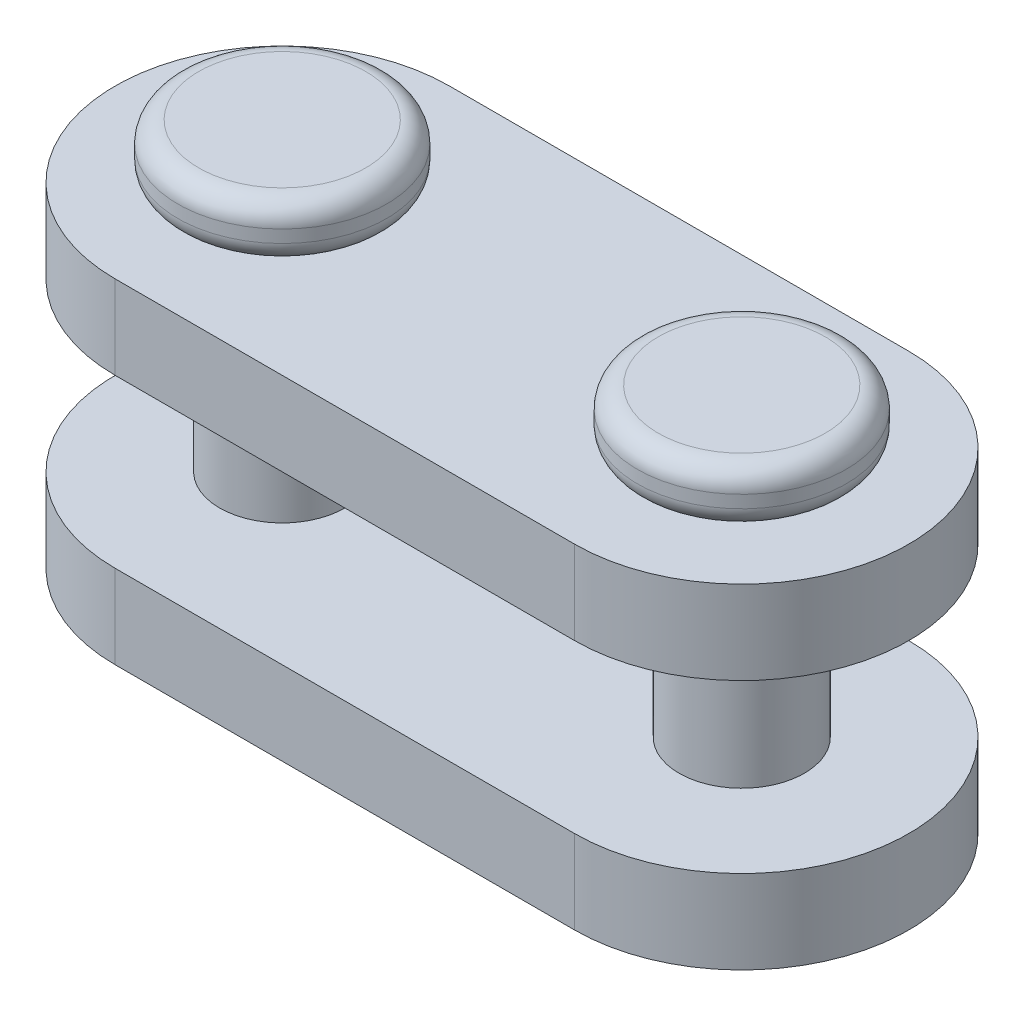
ISO-10303-21;
HEADER;
FILE_DESCRIPTION(('STEP AP214'),'2;1');
FILE_NAME('part.step','',(''),(''),'','','');
FILE_SCHEMA(('AUTOMOTIVE_DESIGN { 1 0 10303 214 1 1 1 1 }'));
ENDSEC;
DATA;
#1=APPLICATION_CONTEXT('core data for automotive mechanical design processes');
#2=APPLICATION_PROTOCOL_DEFINITION('international standard','automotive_design',2000,#1);
#3=PRODUCT_CONTEXT('',#1,'mechanical');
#4=PRODUCT('Part','Part','',(#3));
#5=PRODUCT_RELATED_PRODUCT_CATEGORY('part','',(#4));
#6=PRODUCT_DEFINITION_FORMATION('','',#4);
#7=PRODUCT_DEFINITION_CONTEXT('part definition',#1,'design');
#8=PRODUCT_DEFINITION('design','',#6,#7);
#9=PRODUCT_DEFINITION_SHAPE('','',#8);
#10=(LENGTH_UNIT() NAMED_UNIT(*) SI_UNIT(.MILLI.,.METRE.));
#11=(NAMED_UNIT(*) PLANE_ANGLE_UNIT() SI_UNIT($,.RADIAN.));
#12=(NAMED_UNIT(*) SI_UNIT($,.STERADIAN.) SOLID_ANGLE_UNIT());
#13=UNCERTAINTY_MEASURE_WITH_UNIT(LENGTH_MEASURE(1.E-05),#10,'distance_accuracy_value','');
#14=(GEOMETRIC_REPRESENTATION_CONTEXT(3) GLOBAL_UNCERTAINTY_ASSIGNED_CONTEXT((#13)) GLOBAL_UNIT_ASSIGNED_CONTEXT((#10,
#11,#12)) REPRESENTATION_CONTEXT('',''));
#15=CARTESIAN_POINT('',(0.,0.,0.));
#16=DIRECTION('',(0.,0.,1.));
#17=DIRECTION('',(1.,0.,0.));
#18=AXIS2_PLACEMENT_3D('',#15,#16,#17);
#19=CARTESIAN_POINT('',(0.,3.9999999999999,0.));
#20=DIRECTION('',(0.,-1.,0.));
#21=DIRECTION('',(0.526985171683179,0.,-0.849874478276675));
#22=AXIS2_PLACEMENT_3D('',#19,#20,#21);
#23=CYLINDRICAL_SURFACE('',#22,1.5);
#24=CARTESIAN_POINT('',(0.,-2.,0.));
#25=DIRECTION('',(0.,1.,0.));
#26=DIRECTION('',(-0.999240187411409,0.,-0.0389749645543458));
#27=AXIS2_PLACEMENT_3D('',#24,#25,#26);
#28=CIRCLE('',#27,1.5);
#29=CARTESIAN_POINT('',(-1.49886028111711,-2.,-0.0584624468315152));
#30=VERTEX_POINT('',#29);
#31=EDGE_CURVE('E9',#30,#30,#28,.F.);
#32=ORIENTED_EDGE('',*,*,#31,.F.);
#33=EDGE_LOOP('',(#32));
#34=FACE_BOUND('',#33,.T.);
#35=CARTESIAN_POINT('',(0.,1.99999999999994,0.));
#36=DIRECTION('',(0.,1.,0.));
#37=DIRECTION('',(-0.999240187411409,0.,-0.0389749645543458));
#38=AXIS2_PLACEMENT_3D('',#35,#36,#37);
#39=CIRCLE('',#38,1.5);
#40=CARTESIAN_POINT('',(-1.49886028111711,1.99999999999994,-0.0584624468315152));
#41=VERTEX_POINT('',#40);
#42=EDGE_CURVE('E26',#41,#41,#39,.F.);
#43=ORIENTED_EDGE('',*,*,#42,.T.);
#44=EDGE_LOOP('',(#43));
#45=FACE_BOUND('',#44,.T.);
#46=ADVANCED_FACE('F14',(#34,#45),#23,.T.);
#47=CARTESIAN_POINT('',(0.,-5.30000000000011,0.));
#48=DIRECTION('',(0.,1.,0.));
#49=DIRECTION('',(-0.526985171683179,0.,0.849874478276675));
#50=AXIS2_PLACEMENT_3D('',#47,#48,#49);
#51=PLANE('',#50);
#52=CARTESIAN_POINT('',(0.,-5.30000000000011,0.));
#53=DIRECTION('',(0.,1.,0.));
#54=DIRECTION('',(-0.526985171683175,0.,0.849874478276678));
#55=AXIS2_PLACEMENT_3D('',#52,#53,#54);
#56=CIRCLE('',#55,1.99999999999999);
#57=CARTESIAN_POINT('',(-1.05397034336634,-5.30000000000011,1.69974895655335));
#58=VERTEX_POINT('',#57);
#59=CARTESIAN_POINT('',(1.05397034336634,-5.3000000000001,-1.69974895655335));
#60=VERTEX_POINT('',#59);
#61=EDGE_CURVE('E602',#58,#60,#56,.T.);
#62=ORIENTED_EDGE('',*,*,#61,.F.);
#63=CARTESIAN_POINT('',(0.,-5.30000000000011,0.));
#64=DIRECTION('',(0.,1.,0.));
#65=DIRECTION('',(0.526985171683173,0.,-0.849874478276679));
#66=AXIS2_PLACEMENT_3D('',#63,#64,#65);
#67=CIRCLE('',#66,1.99999999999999);
#68=EDGE_CURVE('E604',#60,#58,#67,.T.);
#69=ORIENTED_EDGE('',*,*,#68,.F.);
#70=EDGE_LOOP('',(#62,#69));
#71=FACE_BOUND('',#70,.T.);
#72=ADVANCED_FACE('F257',(#71),#51,.F.);
#73=CARTESIAN_POINT('',(0.,-4.80000000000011,0.));
#74=DIRECTION('',(0.,1.,0.));
#75=DIRECTION('',(-0.526985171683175,0.,0.849874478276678));
#76=AXIS2_PLACEMENT_3D('',#73,#74,#75);
#77=TOROIDAL_SURFACE('',#76,1.99999999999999,0.5);
#78=ORIENTED_EDGE('',*,*,#61,.T.);
#79=ORIENTED_EDGE('',*,*,#68,.T.);
#80=EDGE_LOOP('',(#78,#79));
#81=FACE_BOUND('',#80,.T.);
#82=CARTESIAN_POINT('',(0.,-4.80000000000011,0.));
#83=DIRECTION('',(0.,-1.,0.));
#84=DIRECTION('',(0.526985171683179,0.,-0.849874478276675));
#85=AXIS2_PLACEMENT_3D('',#82,#83,#84);
#86=CIRCLE('',#85,2.5);
#87=CARTESIAN_POINT('',(1.31746292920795,-4.80000000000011,-2.12468619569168));
#88=VERTEX_POINT('',#87);
#89=EDGE_CURVE('E239',#88,#88,#86,.F.);
#90=ORIENTED_EDGE('',*,*,#89,.F.);
#91=EDGE_LOOP('',(#90));
#92=FACE_BOUND('',#91,.T.);
#93=ADVANCED_FACE('F251',(#81,#92),#77,.T.);
#94=CARTESIAN_POINT('',(0.,-4.00000000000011,0.));
#95=DIRECTION('',(0.,-1.,0.));
#96=DIRECTION('',(0.526985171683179,0.,-0.849874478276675));
#97=AXIS2_PLACEMENT_3D('',#94,#95,#96);
#98=CYLINDRICAL_SURFACE('',#97,2.5);
#99=CARTESIAN_POINT('',(0.,-4.50000000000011,0.));
#100=DIRECTION('',(0.,1.,0.));
#101=DIRECTION('',(-0.526985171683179,0.,0.849874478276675));
#102=AXIS2_PLACEMENT_3D('',#99,#100,#101);
#103=CIRCLE('',#102,2.5);
#104=CARTESIAN_POINT('',(-1.31746292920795,-4.50000000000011,2.12468619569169));
#105=VERTEX_POINT('',#104);
#106=EDGE_CURVE('E232',#105,#105,#103,.T.);
#107=ORIENTED_EDGE('',*,*,#106,.F.);
#108=EDGE_LOOP('',(#107));
#109=FACE_BOUND('',#108,.T.);
#110=ORIENTED_EDGE('',*,*,#89,.T.);
#111=EDGE_LOOP('',(#110));
#112=FACE_BOUND('',#111,.T.);
#113=ADVANCED_FACE('F256',(#109,#112),#98,.T.);
#114=CARTESIAN_POINT('',(0.,-4.50000000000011,0.));
#115=DIRECTION('',(0.,1.,0.));
#116=DIRECTION('',(-0.526985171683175,0.,0.849874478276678));
#117=AXIS2_PLACEMENT_3D('',#114,#115,#116);
#118=TOROIDAL_SURFACE('',#117,1.99999999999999,0.5);
#119=ORIENTED_EDGE('',*,*,#106,.T.);
#120=EDGE_LOOP('',(#119));
#121=FACE_BOUND('',#120,.T.);
#122=CARTESIAN_POINT('',(0.,-4.00000000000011,0.));
#123=DIRECTION('',(0.,-1.,0.));
#124=DIRECTION('',(-0.526985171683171,0.,0.84987447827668));
#125=AXIS2_PLACEMENT_3D('',#122,#123,#124);
#126=CIRCLE('',#125,1.99999999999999);
#127=CARTESIAN_POINT('',(1.05397034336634,-4.00000000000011,-1.69974895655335));
#128=VERTEX_POINT('',#127);
#129=CARTESIAN_POINT('',(-1.05397034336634,-4.00000000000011,1.69974895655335));
#130=VERTEX_POINT('',#129);
#131=EDGE_CURVE('E34',#128,#130,#126,.F.);
#132=ORIENTED_EDGE('',*,*,#131,.F.);
#133=CARTESIAN_POINT('',(0.,-4.00000000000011,0.));
#134=DIRECTION('',(0.,-1.,0.));
#135=DIRECTION('',(0.526985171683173,0.,-0.849874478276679));
#136=AXIS2_PLACEMENT_3D('',#133,#134,#135);
#137=CIRCLE('',#136,1.99999999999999);
#138=EDGE_CURVE('E229',#130,#128,#137,.F.);
#139=ORIENTED_EDGE('',*,*,#138,.F.);
#140=EDGE_LOOP('',(#132,#139));
#141=FACE_BOUND('',#140,.T.);
#142=ADVANCED_FACE('F525',(#121,#141),#118,.T.);
#143=CARTESIAN_POINT('',(0.,5.29999999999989,0.));
#144=DIRECTION('',(0.,-1.,0.));
#145=DIRECTION('',(0.526985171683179,0.,-0.849874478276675));
#146=AXIS2_PLACEMENT_3D('',#143,#144,#145);
#147=PLANE('',#146);
#148=CARTESIAN_POINT('',(0.,5.29999999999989,0.));
#149=DIRECTION('',(0.,-1.,0.));
#150=DIRECTION('',(0.526985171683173,0.,-0.849874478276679));
#151=AXIS2_PLACEMENT_3D('',#148,#149,#150);
#152=CIRCLE('',#151,2.);
#153=CARTESIAN_POINT('',(1.05397034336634,5.29999999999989,-1.69974895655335));
#154=VERTEX_POINT('',#153);
#155=CARTESIAN_POINT('',(-1.05397034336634,5.29999999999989,1.69974895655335));
#156=VERTEX_POINT('',#155);
#157=EDGE_CURVE('E284',#154,#156,#152,.T.);
#158=ORIENTED_EDGE('',*,*,#157,.F.);
#159=CARTESIAN_POINT('',(0.,5.29999999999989,0.));
#160=DIRECTION('',(0.,-1.,0.));
#161=DIRECTION('',(-0.526985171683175,0.,0.849874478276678));
#162=AXIS2_PLACEMENT_3D('',#159,#160,#161);
#163=CIRCLE('',#162,2.);
#164=EDGE_CURVE('E601',#156,#154,#163,.T.);
#165=ORIENTED_EDGE('',*,*,#164,.F.);
#166=EDGE_LOOP('',(#158,#165));
#167=FACE_BOUND('',#166,.T.);
#168=ADVANCED_FACE('F626',(#167),#147,.F.);
#169=CARTESIAN_POINT('',(0.,4.79999999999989,0.));
#170=DIRECTION('',(0.,-1.,0.));
#171=DIRECTION('',(0.526985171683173,0.,-0.849874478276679));
#172=AXIS2_PLACEMENT_3D('',#169,#170,#171);
#173=TOROIDAL_SURFACE('',#172,2.,0.5);
#174=ORIENTED_EDGE('',*,*,#157,.T.);
#175=ORIENTED_EDGE('',*,*,#164,.T.);
#176=EDGE_LOOP('',(#174,#175));
#177=FACE_BOUND('',#176,.T.);
#178=CARTESIAN_POINT('',(0.,4.79999999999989,0.));
#179=DIRECTION('',(0.,1.,0.));
#180=DIRECTION('',(-0.526985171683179,0.,0.849874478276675));
#181=AXIS2_PLACEMENT_3D('',#178,#179,#180);
#182=CIRCLE('',#181,2.5);
#183=CARTESIAN_POINT('',(-1.31746292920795,4.79999999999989,2.12468619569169));
#184=VERTEX_POINT('',#183);
#185=EDGE_CURVE('E607',#184,#184,#182,.F.);
#186=ORIENTED_EDGE('',*,*,#185,.F.);
#187=EDGE_LOOP('',(#186));
#188=FACE_BOUND('',#187,.T.);
#189=ADVANCED_FACE('F261',(#177,#188),#173,.T.);
#190=CARTESIAN_POINT('',(0.,3.9999999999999,0.));
#191=DIRECTION('',(0.,1.,0.));
#192=DIRECTION('',(-0.526985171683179,0.,0.849874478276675));
#193=AXIS2_PLACEMENT_3D('',#190,#191,#192);
#194=CYLINDRICAL_SURFACE('',#193,2.5);
#195=CARTESIAN_POINT('',(0.,4.49999999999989,0.));
#196=DIRECTION('',(0.,-1.,0.));
#197=DIRECTION('',(0.526985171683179,0.,-0.849874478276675));
#198=AXIS2_PLACEMENT_3D('',#195,#196,#197);
#199=CIRCLE('',#198,2.5);
#200=CARTESIAN_POINT('',(1.31746292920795,4.4999999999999,-2.12468619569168));
#201=VERTEX_POINT('',#200);
#202=EDGE_CURVE('E234',#201,#201,#199,.T.);
#203=ORIENTED_EDGE('',*,*,#202,.F.);
#204=EDGE_LOOP('',(#203));
#205=FACE_BOUND('',#204,.T.);
#206=ORIENTED_EDGE('',*,*,#185,.T.);
#207=EDGE_LOOP('',(#206));
#208=FACE_BOUND('',#207,.T.);
#209=ADVANCED_FACE('F259',(#205,#208),#194,.T.);
#210=CARTESIAN_POINT('',(0.,4.49999999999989,0.));
#211=DIRECTION('',(0.,-1.,0.));
#212=DIRECTION('',(0.526985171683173,0.,-0.849874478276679));
#213=AXIS2_PLACEMENT_3D('',#210,#211,#212);
#214=TOROIDAL_SURFACE('',#213,2.,0.5);
#215=ORIENTED_EDGE('',*,*,#202,.T.);
#216=EDGE_LOOP('',(#215));
#217=FACE_BOUND('',#216,.T.);
#218=CARTESIAN_POINT('',(0.,3.99999999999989,0.));
#219=DIRECTION('',(0.,1.,0.));
#220=DIRECTION('',(0.526985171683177,0.,-0.849874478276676));
#221=AXIS2_PLACEMENT_3D('',#218,#219,#220);
#222=CIRCLE('',#221,2.);
#223=CARTESIAN_POINT('',(-1.05397034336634,3.9999999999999,1.69974895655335));
#224=VERTEX_POINT('',#223);
#225=CARTESIAN_POINT('',(1.05397034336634,3.9999999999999,-1.69974895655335));
#226=VERTEX_POINT('',#225);
#227=EDGE_CURVE('E231',#224,#226,#222,.F.);
#228=ORIENTED_EDGE('',*,*,#227,.F.);
#229=CARTESIAN_POINT('',(0.,3.99999999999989,0.));
#230=DIRECTION('',(0.,1.,0.));
#231=DIRECTION('',(-0.526985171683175,0.,0.849874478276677));
#232=AXIS2_PLACEMENT_3D('',#229,#230,#231);
#233=CIRCLE('',#232,2.);
#234=EDGE_CURVE('E211',#226,#224,#233,.F.);
#235=ORIENTED_EDGE('',*,*,#234,.F.);
#236=EDGE_LOOP('',(#228,#235));
#237=FACE_BOUND('',#236,.T.);
#238=ADVANCED_FACE('F519',(#217,#237),#214,.T.);
#239=CARTESIAN_POINT('',(11.0000000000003,5.3,2.18575157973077E-13));
#240=DIRECTION('',(0.,-1.,0.));
#241=DIRECTION('',(0.871208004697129,0.,0.490914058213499));
#242=AXIS2_PLACEMENT_3D('',#239,#240,#241);
#243=PLANE('',#242);
#244=CARTESIAN_POINT('',(11.0000000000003,5.3,2.18606178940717E-13));
#245=DIRECTION('',(0.,-1.,0.));
#246=DIRECTION('',(0.871208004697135,0.,0.490914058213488));
#247=AXIS2_PLACEMENT_3D('',#244,#245,#246);
#248=CIRCLE('',#247,1.99999999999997);
#249=CARTESIAN_POINT('',(12.7424160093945,5.3,0.981828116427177));
#250=VERTEX_POINT('',#249);
#251=CARTESIAN_POINT('',(9.25758399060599,5.3,-0.981828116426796));
#252=VERTEX_POINT('',#251);
#253=EDGE_CURVE('E418',#250,#252,#248,.T.);
#254=ORIENTED_EDGE('',*,*,#253,.F.);
#255=CARTESIAN_POINT('',(11.0000000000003,5.3,2.18606178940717E-13));
#256=DIRECTION('',(0.,-1.,0.));
#257=DIRECTION('',(-0.871208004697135,0.,-0.49091405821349));
#258=AXIS2_PLACEMENT_3D('',#255,#256,#257);
#259=CIRCLE('',#258,1.99999999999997);
#260=EDGE_CURVE('E429',#252,#250,#259,.T.);
#261=ORIENTED_EDGE('',*,*,#260,.F.);
#262=EDGE_LOOP('',(#254,#261));
#263=FACE_BOUND('',#262,.T.);
#264=ADVANCED_FACE('F395',(#263),#243,.F.);
#265=CARTESIAN_POINT('',(11.0000000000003,-5.3,2.18575157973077E-13));
#266=DIRECTION('',(0.,1.,0.));
#267=DIRECTION('',(-0.871208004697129,0.,-0.490914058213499));
#268=AXIS2_PLACEMENT_3D('',#265,#266,#267);
#269=PLANE('',#268);
#270=CARTESIAN_POINT('',(11.0000000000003,-5.3,2.18544137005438E-13));
#271=DIRECTION('',(0.,1.,0.));
#272=DIRECTION('',(-0.871208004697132,0.,-0.490914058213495));
#273=AXIS2_PLACEMENT_3D('',#270,#271,#272);
#274=CIRCLE('',#273,2.00000000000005);
#275=CARTESIAN_POINT('',(9.25758399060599,-5.3,-0.981828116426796));
#276=VERTEX_POINT('',#275);
#277=CARTESIAN_POINT('',(12.7424160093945,-5.3,0.981828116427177));
#278=VERTEX_POINT('',#277);
#279=EDGE_CURVE('E342',#276,#278,#274,.T.);
#280=ORIENTED_EDGE('',*,*,#279,.F.);
#281=CARTESIAN_POINT('',(11.0000000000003,-5.3,2.18544137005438E-13));
#282=DIRECTION('',(0.,1.,0.));
#283=DIRECTION('',(0.871208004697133,0.,0.490914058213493));
#284=AXIS2_PLACEMENT_3D('',#281,#282,#283);
#285=CIRCLE('',#284,2.00000000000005);
#286=EDGE_CURVE('E380',#278,#276,#285,.T.);
#287=ORIENTED_EDGE('',*,*,#286,.F.);
#288=EDGE_LOOP('',(#280,#287));
#289=FACE_BOUND('',#288,.T.);
#290=ADVANCED_FACE('F362',(#289),#269,.F.);
#291=CARTESIAN_POINT('',(11.0000000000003,4.8,2.18575157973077E-13));
#292=DIRECTION('',(0.,-1.,0.));
#293=DIRECTION('',(0.871208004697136,0.,0.490914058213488));
#294=AXIS2_PLACEMENT_3D('',#291,#292,#293);
#295=TOROIDAL_SURFACE('',#294,1.99999999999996,0.5);
#296=ORIENTED_EDGE('',*,*,#253,.T.);
#297=ORIENTED_EDGE('',*,*,#260,.T.);
#298=EDGE_LOOP('',(#296,#297));
#299=FACE_BOUND('',#298,.T.);
#300=CARTESIAN_POINT('',(11.0000000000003,4.8,2.18575157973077E-13));
#301=DIRECTION('',(0.,1.,0.));
#302=DIRECTION('',(-0.871208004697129,0.,-0.490914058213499));
#303=AXIS2_PLACEMENT_3D('',#300,#301,#302);
#304=CIRCLE('',#303,2.5);
#305=CARTESIAN_POINT('',(8.82197998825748,4.8,-1.22728514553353));
#306=VERTEX_POINT('',#305);
#307=EDGE_CURVE('E375',#306,#306,#304,.F.);
#308=ORIENTED_EDGE('',*,*,#307,.F.);
#309=EDGE_LOOP('',(#308));
#310=FACE_BOUND('',#309,.T.);
#311=ADVANCED_FACE('F361',(#299,#310),#295,.T.);
#312=CARTESIAN_POINT('',(11.0000000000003,-4.8,2.18575157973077E-13));
#313=DIRECTION('',(0.,1.,0.));
#314=DIRECTION('',(-0.871208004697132,0.,-0.490914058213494));
#315=AXIS2_PLACEMENT_3D('',#312,#313,#314);
#316=TOROIDAL_SURFACE('',#315,2.00000000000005,0.5);
#317=ORIENTED_EDGE('',*,*,#279,.T.);
#318=ORIENTED_EDGE('',*,*,#286,.T.);
#319=EDGE_LOOP('',(#317,#318));
#320=FACE_BOUND('',#319,.T.);
#321=CARTESIAN_POINT('',(11.0000000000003,-4.8,2.18575157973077E-13));
#322=DIRECTION('',(0.,-1.,0.));
#323=DIRECTION('',(0.871208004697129,0.,0.490914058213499));
#324=AXIS2_PLACEMENT_3D('',#321,#322,#323);
#325=CIRCLE('',#324,2.5);
#326=CARTESIAN_POINT('',(13.1780200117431,-4.8,1.22728514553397));
#327=VERTEX_POINT('',#326);
#328=EDGE_CURVE('E373',#327,#327,#325,.F.);
#329=ORIENTED_EDGE('',*,*,#328,.F.);
#330=EDGE_LOOP('',(#329));
#331=FACE_BOUND('',#330,.T.);
#332=ADVANCED_FACE('F349',(#320,#331),#316,.T.);
#333=CARTESIAN_POINT('',(11.0000000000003,4.,2.18575157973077E-13));
#334=DIRECTION('',(0.,1.,0.));
#335=DIRECTION('',(-0.871208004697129,0.,-0.490914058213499));
#336=AXIS2_PLACEMENT_3D('',#333,#334,#335);
#337=CYLINDRICAL_SURFACE('',#336,2.5);
#338=CARTESIAN_POINT('',(11.0000000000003,4.5,2.18575157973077E-13));
#339=DIRECTION('',(0.,-1.,0.));
#340=DIRECTION('',(0.871208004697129,0.,0.490914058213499));
#341=AXIS2_PLACEMENT_3D('',#338,#339,#340);
#342=CIRCLE('',#341,2.5);
#343=CARTESIAN_POINT('',(13.1780200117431,4.5,1.22728514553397));
#344=VERTEX_POINT('',#343);
#345=EDGE_CURVE('E371',#344,#344,#342,.T.);
#346=ORIENTED_EDGE('',*,*,#345,.F.);
#347=EDGE_LOOP('',(#346));
#348=FACE_BOUND('',#347,.T.);
#349=ORIENTED_EDGE('',*,*,#307,.T.);
#350=EDGE_LOOP('',(#349));
#351=FACE_BOUND('',#350,.T.);
#352=ADVANCED_FACE('F360',(#348,#351),#337,.T.);
#353=CARTESIAN_POINT('',(11.0000000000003,-4.,2.18575157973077E-13));
#354=DIRECTION('',(0.,-1.,0.));
#355=DIRECTION('',(0.871208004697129,0.,0.490914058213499));
#356=AXIS2_PLACEMENT_3D('',#353,#354,#355);
#357=CYLINDRICAL_SURFACE('',#356,2.5);
#358=CARTESIAN_POINT('',(11.0000000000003,-4.5,2.18575157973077E-13));
#359=DIRECTION('',(0.,1.,0.));
#360=DIRECTION('',(-0.871208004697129,0.,-0.490914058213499));
#361=AXIS2_PLACEMENT_3D('',#358,#359,#360);
#362=CIRCLE('',#361,2.5);
#363=CARTESIAN_POINT('',(8.82197998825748,-4.5,-1.22728514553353));
#364=VERTEX_POINT('',#363);
#365=EDGE_CURVE('E550',#364,#364,#362,.T.);
#366=ORIENTED_EDGE('',*,*,#365,.F.);
#367=EDGE_LOOP('',(#366));
#368=FACE_BOUND('',#367,.T.);
#369=ORIENTED_EDGE('',*,*,#328,.T.);
#370=EDGE_LOOP('',(#369));
#371=FACE_BOUND('',#370,.T.);
#372=ADVANCED_FACE('F307',(#368,#371),#357,.T.);
#373=CARTESIAN_POINT('',(11.0000000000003,4.,2.18575157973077E-13));
#374=DIRECTION('',(0.,-1.,0.));
#375=DIRECTION('',(0.871208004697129,0.,0.490914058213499));
#376=AXIS2_PLACEMENT_3D('',#373,#374,#375);
#377=CYLINDRICAL_SURFACE('',#376,1.5);
#378=CARTESIAN_POINT('',(11.0000000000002,1.99999999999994,0.));
#379=DIRECTION('',(0.,1.,0.));
#380=DIRECTION('',(-0.999999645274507,0.,0.000842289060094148));
#381=AXIS2_PLACEMENT_3D('',#378,#379,#380);
#382=CIRCLE('',#381,1.500000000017);
#383=CARTESIAN_POINT('',(9.5000005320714,1.99999999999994,0.00126343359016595));
#384=VERTEX_POINT('',#383);
#385=EDGE_CURVE('E484',#384,#384,#382,.F.);
#386=ORIENTED_EDGE('',*,*,#385,.T.);
#387=EDGE_LOOP('',(#386));
#388=FACE_BOUND('',#387,.T.);
#389=CARTESIAN_POINT('',(11.0000000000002,-2.,0.));
#390=DIRECTION('',(0.,1.,0.));
#391=DIRECTION('',(-0.999999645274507,0.,0.000842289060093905));
#392=AXIS2_PLACEMENT_3D('',#389,#390,#391);
#393=CIRCLE('',#392,1.500000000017);
#394=CARTESIAN_POINT('',(9.5000005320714,-2.,0.00126343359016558));
#395=VERTEX_POINT('',#394);
#396=EDGE_CURVE('E458',#395,#395,#393,.T.);
#397=ORIENTED_EDGE('',*,*,#396,.T.);
#398=EDGE_LOOP('',(#397));
#399=FACE_BOUND('',#398,.T.);
#400=ADVANCED_FACE('F308',(#388,#399),#377,.T.);
#401=CARTESIAN_POINT('',(11.0000000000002,3.99999999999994,0.));
#402=DIRECTION('',(0.,-1.,0.));
#403=DIRECTION('',(0.999999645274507,0.,-0.000842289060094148));
#404=AXIS2_PLACEMENT_3D('',#401,#402,#403);
#405=CYLINDRICAL_SURFACE('',#404,4.);
#406=CARTESIAN_POINT('',(11.0000000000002,1.99999999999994,0.));
#407=DIRECTION('',(0.,-1.,0.));
#408=DIRECTION('',(0.999999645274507,0.,-0.000842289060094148));
#409=AXIS2_PLACEMENT_3D('',#406,#407,#408);
#410=CIRCLE('',#409,4.);
#411=CARTESIAN_POINT('',(11.0000000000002,1.99999999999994,4.));
#412=VERTEX_POINT('',#411);
#413=CARTESIAN_POINT('',(11.0000000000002,1.99999999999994,-4.));
#414=VERTEX_POINT('',#413);
#415=EDGE_CURVE('E128',#412,#414,#410,.F.);
#416=ORIENTED_EDGE('',*,*,#415,.T.);
#417=DIRECTION('',(0.,1.,0.));
#418=VECTOR('',#417,1.);
#419=CARTESIAN_POINT('',(11.0000000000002,3.99999999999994,-4.));
#420=LINE('',#419,#418);
#421=CARTESIAN_POINT('',(11.0000000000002,3.99999999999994,-4.));
#422=VERTEX_POINT('',#421);
#423=EDGE_CURVE('E132',#414,#422,#420,.T.);
#424=ORIENTED_EDGE('',*,*,#423,.T.);
#425=CARTESIAN_POINT('',(11.0000000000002,3.99999999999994,0.));
#426=DIRECTION('',(0.,-1.,0.));
#427=DIRECTION('',(0.999999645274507,0.,-0.000842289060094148));
#428=AXIS2_PLACEMENT_3D('',#425,#426,#427);
#429=CIRCLE('',#428,4.);
#430=CARTESIAN_POINT('',(11.0000000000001,3.99999999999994,4.));
#431=VERTEX_POINT('',#430);
#432=EDGE_CURVE('E156',#431,#422,#429,.F.);
#433=ORIENTED_EDGE('',*,*,#432,.F.);
#434=DIRECTION('',(0.,1.,0.));
#435=VECTOR('',#434,1.);
#436=CARTESIAN_POINT('',(11.0000000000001,3.99999999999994,4.));
#437=LINE('',#436,#435);
#438=EDGE_CURVE('E135',#431,#412,#437,.F.);
#439=ORIENTED_EDGE('',*,*,#438,.T.);
#440=EDGE_LOOP('',(#416,#424,#433,#439));
#441=FACE_BOUND('',#440,.T.);
#442=ADVANCED_FACE('F130',(#441),#405,.T.);
#443=CARTESIAN_POINT('',(11.0000000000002,3.99999999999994,-4.));
#444=DIRECTION('',(0.,0.,1.));
#445=DIRECTION('',(1.,0.,0.));
#446=AXIS2_PLACEMENT_3D('',#443,#444,#445);
#447=PLANE('',#446);
#448=DIRECTION('',(0.,-1.,0.));
#449=VECTOR('',#448,1.);
#450=CARTESIAN_POINT('',(0.,3.99999999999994,-4.00000000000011));
#451=LINE('',#450,#449);
#452=CARTESIAN_POINT('',(0.,3.99999999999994,-4.00000000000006));
#453=VERTEX_POINT('',#452);
#454=CARTESIAN_POINT('',(0.,1.99999999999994,-4.00000000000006));
#455=VERTEX_POINT('',#454);
#456=EDGE_CURVE('E153',#453,#455,#451,.T.);
#457=ORIENTED_EDGE('',*,*,#456,.F.);
#458=DIRECTION('',(-1.,0.,0.));
#459=VECTOR('',#458,1.);
#460=CARTESIAN_POINT('',(11.0000000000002,3.99999999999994,-4.));
#461=LINE('',#460,#459);
#462=EDGE_CURVE('E149',#422,#453,#461,.T.);
#463=ORIENTED_EDGE('',*,*,#462,.F.);
#464=ORIENTED_EDGE('',*,*,#423,.F.);
#465=DIRECTION('',(1.,0.,0.));
#466=VECTOR('',#465,1.);
#467=CARTESIAN_POINT('',(11.0000000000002,1.99999999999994,-4.));
#468=LINE('',#467,#466);
#469=EDGE_CURVE('E141',#455,#414,#468,.T.);
#470=ORIENTED_EDGE('',*,*,#469,.F.);
#471=EDGE_LOOP('',(#457,#463,#464,#470));
#472=FACE_BOUND('',#471,.T.);
#473=ADVANCED_FACE('F147',(#472),#447,.F.);
#474=CARTESIAN_POINT('',(0.,3.99999999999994,0.));
#475=DIRECTION('',(0.,-1.,0.));
#476=DIRECTION('',(0.999999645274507,0.,-0.000842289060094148));
#477=AXIS2_PLACEMENT_3D('',#474,#475,#476);
#478=CYLINDRICAL_SURFACE('',#477,4.00000000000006);
#479=CARTESIAN_POINT('',(0.,3.99999999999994,0.));
#480=DIRECTION('',(0.,-1.,0.));
#481=DIRECTION('',(0.999999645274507,0.,-0.000842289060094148));
#482=AXIS2_PLACEMENT_3D('',#479,#480,#481);
#483=CIRCLE('',#482,4.00000000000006);
#484=CARTESIAN_POINT('',(1.17961196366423E-13,3.99999999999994,4.));
#485=VERTEX_POINT('',#484);
#486=EDGE_CURVE('E158',#453,#485,#483,.F.);
#487=ORIENTED_EDGE('',*,*,#486,.F.);
#488=ORIENTED_EDGE('',*,*,#456,.T.);
#489=CARTESIAN_POINT('',(0.,1.99999999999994,0.));
#490=DIRECTION('',(0.,-1.,0.));
#491=DIRECTION('',(0.999999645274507,0.,-0.000842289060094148));
#492=AXIS2_PLACEMENT_3D('',#489,#490,#491);
#493=CIRCLE('',#492,4.00000000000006);
#494=CARTESIAN_POINT('',(1.17961196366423E-13,1.99999999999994,4.));
#495=VERTEX_POINT('',#494);
#496=EDGE_CURVE('E143',#455,#495,#493,.F.);
#497=ORIENTED_EDGE('',*,*,#496,.T.);
#498=DIRECTION('',(0.,1.,0.));
#499=VECTOR('',#498,1.);
#500=CARTESIAN_POINT('',(1.66533453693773E-13,3.99999999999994,4.));
#501=LINE('',#500,#499);
#502=EDGE_CURVE('E491',#495,#485,#501,.T.);
#503=ORIENTED_EDGE('',*,*,#502,.T.);
#504=EDGE_LOOP('',(#487,#488,#497,#503));
#505=FACE_BOUND('',#504,.T.);
#506=ADVANCED_FACE('F496',(#505),#478,.T.);
#507=CARTESIAN_POINT('',(11.0000000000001,3.99999999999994,4.));
#508=DIRECTION('',(0.,0.,-1.));
#509=DIRECTION('',(-1.,0.,0.));
#510=AXIS2_PLACEMENT_3D('',#507,#508,#509);
#511=PLANE('',#510);
#512=ORIENTED_EDGE('',*,*,#438,.F.);
#513=DIRECTION('',(1.,0.,0.));
#514=VECTOR('',#513,1.);
#515=CARTESIAN_POINT('',(1.66533453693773E-13,3.99999999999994,4.));
#516=LINE('',#515,#514);
#517=EDGE_CURVE('E161',#485,#431,#516,.T.);
#518=ORIENTED_EDGE('',*,*,#517,.F.);
#519=ORIENTED_EDGE('',*,*,#502,.F.);
#520=DIRECTION('',(-1.,0.,0.));
#521=VECTOR('',#520,1.);
#522=CARTESIAN_POINT('',(11.0000000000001,1.99999999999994,4.));
#523=LINE('',#522,#521);
#524=EDGE_CURVE('E155',#412,#495,#523,.T.);
#525=ORIENTED_EDGE('',*,*,#524,.F.);
#526=EDGE_LOOP('',(#512,#518,#519,#525));
#527=FACE_BOUND('',#526,.T.);
#528=ADVANCED_FACE('F185',(#527),#511,.F.);
#529=CARTESIAN_POINT('',(11.0000000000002,1.99999999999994,0.));
#530=DIRECTION('',(0.,1.,0.));
#531=DIRECTION('',(-0.999999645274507,0.,0.000842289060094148));
#532=AXIS2_PLACEMENT_3D('',#529,#530,#531);
#533=PLANE('',#532);
#534=ORIENTED_EDGE('',*,*,#524,.T.);
#535=ORIENTED_EDGE('',*,*,#496,.F.);
#536=ORIENTED_EDGE('',*,*,#469,.T.);
#537=ORIENTED_EDGE('',*,*,#415,.F.);
#538=EDGE_LOOP('',(#534,#535,#536,#537));
#539=FACE_BOUND('',#538,.T.);
#540=ORIENTED_EDGE('',*,*,#385,.F.);
#541=EDGE_LOOP('',(#540));
#542=FACE_BOUND('',#541,.T.);
#543=ORIENTED_EDGE('',*,*,#42,.F.);
#544=EDGE_LOOP('',(#543));
#545=FACE_BOUND('',#544,.T.);
#546=ADVANCED_FACE('F16',(#539,#542,#545),#533,.F.);
#547=CARTESIAN_POINT('',(11.0000000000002,-2.,-4.));
#548=DIRECTION('',(0.,0.,1.));
#549=DIRECTION('',(1.,0.,0.));
#550=AXIS2_PLACEMENT_3D('',#547,#548,#549);
#551=PLANE('',#550);
#552=DIRECTION('',(0.,-1.,0.));
#553=VECTOR('',#552,1.);
#554=CARTESIAN_POINT('',(0.,-2.,-4.00000000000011));
#555=LINE('',#554,#553);
#556=CARTESIAN_POINT('',(0.,-2.,-4.00000000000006));
#557=VERTEX_POINT('',#556);
#558=CARTESIAN_POINT('',(0.,-4.,-4.00000000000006));
#559=VERTEX_POINT('',#558);
#560=EDGE_CURVE('E465',#557,#559,#555,.T.);
#561=ORIENTED_EDGE('',*,*,#560,.F.);
#562=DIRECTION('',(-1.,0.,0.));
#563=VECTOR('',#562,1.);
#564=CARTESIAN_POINT('',(11.0000000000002,-2.,-4.));
#565=LINE('',#564,#563);
#566=CARTESIAN_POINT('',(11.0000000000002,-2.,-4.));
#567=VERTEX_POINT('',#566);
#568=EDGE_CURVE('E454',#567,#557,#565,.T.);
#569=ORIENTED_EDGE('',*,*,#568,.F.);
#570=DIRECTION('',(0.,1.,0.));
#571=VECTOR('',#570,1.);
#572=CARTESIAN_POINT('',(11.0000000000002,-2.,-4.));
#573=LINE('',#572,#571);
#574=CARTESIAN_POINT('',(11.0000000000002,-4.,-4.));
#575=VERTEX_POINT('',#574);
#576=EDGE_CURVE('E472',#575,#567,#573,.T.);
#577=ORIENTED_EDGE('',*,*,#576,.F.);
#578=DIRECTION('',(1.,0.,0.));
#579=VECTOR('',#578,1.);
#580=CARTESIAN_POINT('',(11.0000000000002,-4.,-4.));
#581=LINE('',#580,#579);
#582=EDGE_CURVE('E475',#559,#575,#581,.T.);
#583=ORIENTED_EDGE('',*,*,#582,.F.);
#584=EDGE_LOOP('',(#561,#569,#577,#583));
#585=FACE_BOUND('',#584,.T.);
#586=ADVANCED_FACE('F506',(#585),#551,.F.);
#587=CARTESIAN_POINT('',(11.0000000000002,-2.,0.));
#588=DIRECTION('',(0.,-1.,0.));
#589=DIRECTION('',(0.999999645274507,0.,-0.000842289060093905));
#590=AXIS2_PLACEMENT_3D('',#587,#588,#589);
#591=CYLINDRICAL_SURFACE('',#590,4.);
#592=CARTESIAN_POINT('',(11.0000000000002,-4.,0.));
#593=DIRECTION('',(0.,-1.,0.));
#594=DIRECTION('',(0.999999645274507,0.,-0.000842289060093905));
#595=AXIS2_PLACEMENT_3D('',#592,#593,#594);
#596=CIRCLE('',#595,4.);
#597=CARTESIAN_POINT('',(11.0000000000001,-4.,4.));
#598=VERTEX_POINT('',#597);
#599=EDGE_CURVE('E476',#598,#575,#596,.F.);
#600=ORIENTED_EDGE('',*,*,#599,.T.);
#601=ORIENTED_EDGE('',*,*,#576,.T.);
#602=CARTESIAN_POINT('',(11.0000000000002,-2.,0.));
#603=DIRECTION('',(0.,-1.,0.));
#604=DIRECTION('',(0.999999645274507,0.,-0.000842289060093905));
#605=AXIS2_PLACEMENT_3D('',#602,#603,#604);
#606=CIRCLE('',#605,4.);
#607=CARTESIAN_POINT('',(11.0000000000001,-2.,4.));
#608=VERTEX_POINT('',#607);
#609=EDGE_CURVE('E461',#608,#567,#606,.F.);
#610=ORIENTED_EDGE('',*,*,#609,.F.);
#611=DIRECTION('',(0.,1.,0.));
#612=VECTOR('',#611,1.);
#613=CARTESIAN_POINT('',(11.0000000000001,-2.,4.));
#614=LINE('',#613,#612);
#615=EDGE_CURVE('E464',#608,#598,#614,.F.);
#616=ORIENTED_EDGE('',*,*,#615,.T.);
#617=EDGE_LOOP('',(#600,#601,#610,#616));
#618=FACE_BOUND('',#617,.T.);
#619=ADVANCED_FACE('F186',(#618),#591,.T.);
#620=CARTESIAN_POINT('',(11.0000000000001,-2.,4.));
#621=DIRECTION('',(0.,0.,-1.));
#622=DIRECTION('',(-1.,0.,0.));
#623=AXIS2_PLACEMENT_3D('',#620,#621,#622);
#624=PLANE('',#623);
#625=ORIENTED_EDGE('',*,*,#615,.F.);
#626=DIRECTION('',(1.,0.,0.));
#627=VECTOR('',#626,1.);
#628=CARTESIAN_POINT('',(1.66533453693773E-13,-2.,4.));
#629=LINE('',#628,#627);
#630=CARTESIAN_POINT('',(1.17961196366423E-13,-2.,4.));
#631=VERTEX_POINT('',#630);
#632=EDGE_CURVE('E447',#631,#608,#629,.T.);
#633=ORIENTED_EDGE('',*,*,#632,.F.);
#634=DIRECTION('',(0.,1.,0.));
#635=VECTOR('',#634,1.);
#636=CARTESIAN_POINT('',(1.66533453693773E-13,-2.,4.));
#637=LINE('',#636,#635);
#638=CARTESIAN_POINT('',(1.17961196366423E-13,-4.,4.));
#639=VERTEX_POINT('',#638);
#640=EDGE_CURVE('E462',#639,#631,#637,.T.);
#641=ORIENTED_EDGE('',*,*,#640,.F.);
#642=DIRECTION('',(-1.,0.,0.));
#643=VECTOR('',#642,1.);
#644=CARTESIAN_POINT('',(11.0000000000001,-4.,4.));
#645=LINE('',#644,#643);
#646=EDGE_CURVE('E468',#598,#639,#645,.T.);
#647=ORIENTED_EDGE('',*,*,#646,.F.);
#648=EDGE_LOOP('',(#625,#633,#641,#647));
#649=FACE_BOUND('',#648,.T.);
#650=ADVANCED_FACE('F587',(#649),#624,.F.);
#651=CARTESIAN_POINT('',(0.,-2.,0.));
#652=DIRECTION('',(0.,-1.,0.));
#653=DIRECTION('',(0.999999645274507,0.,-0.000842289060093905));
#654=AXIS2_PLACEMENT_3D('',#651,#652,#653);
#655=CYLINDRICAL_SURFACE('',#654,4.00000000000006);
#656=CARTESIAN_POINT('',(0.,-2.,0.));
#657=DIRECTION('',(0.,-1.,0.));
#658=DIRECTION('',(0.999999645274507,0.,-0.000842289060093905));
#659=AXIS2_PLACEMENT_3D('',#656,#657,#658);
#660=CIRCLE('',#659,4.00000000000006);
#661=EDGE_CURVE('E449',#557,#631,#660,.F.);
#662=ORIENTED_EDGE('',*,*,#661,.F.);
#663=ORIENTED_EDGE('',*,*,#560,.T.);
#664=CARTESIAN_POINT('',(0.,-4.,0.));
#665=DIRECTION('',(0.,-1.,0.));
#666=DIRECTION('',(0.999999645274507,0.,-0.000842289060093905));
#667=AXIS2_PLACEMENT_3D('',#664,#665,#666);
#668=CIRCLE('',#667,4.00000000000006);
#669=EDGE_CURVE('E471',#559,#639,#668,.F.);
#670=ORIENTED_EDGE('',*,*,#669,.T.);
#671=ORIENTED_EDGE('',*,*,#640,.T.);
#672=EDGE_LOOP('',(#662,#663,#670,#671));
#673=FACE_BOUND('',#672,.T.);
#674=ADVANCED_FACE('F590',(#673),#655,.T.);
#675=CARTESIAN_POINT('',(11.0000000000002,-2.,0.));
#676=DIRECTION('',(0.,1.,0.));
#677=DIRECTION('',(-0.999999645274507,0.,0.000842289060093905));
#678=AXIS2_PLACEMENT_3D('',#675,#676,#677);
#679=PLANE('',#678);
#680=ORIENTED_EDGE('',*,*,#661,.T.);
#681=ORIENTED_EDGE('',*,*,#632,.T.);
#682=ORIENTED_EDGE('',*,*,#609,.T.);
#683=ORIENTED_EDGE('',*,*,#568,.T.);
#684=EDGE_LOOP('',(#680,#681,#682,#683));
#685=FACE_BOUND('',#684,.T.);
#686=ORIENTED_EDGE('',*,*,#396,.F.);
#687=EDGE_LOOP('',(#686));
#688=FACE_BOUND('',#687,.T.);
#689=ORIENTED_EDGE('',*,*,#31,.T.);
#690=EDGE_LOOP('',(#689));
#691=FACE_BOUND('',#690,.T.);
#692=ADVANCED_FACE('F305',(#685,#688,#691),#679,.T.);
#693=CARTESIAN_POINT('',(11.0000000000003,-4.5,2.18575157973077E-13));
#694=DIRECTION('',(0.,1.,0.));
#695=DIRECTION('',(-0.871208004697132,0.,-0.490914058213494));
#696=AXIS2_PLACEMENT_3D('',#693,#694,#695);
#697=TOROIDAL_SURFACE('',#696,2.00000000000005,0.5);
#698=ORIENTED_EDGE('',*,*,#365,.T.);
#699=EDGE_LOOP('',(#698));
#700=FACE_BOUND('',#699,.T.);
#701=CARTESIAN_POINT('',(11.0000000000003,-4.,2.18606178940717E-13));
#702=DIRECTION('',(0.,-1.,0.));
#703=DIRECTION('',(-0.871208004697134,0.,-0.490914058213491));
#704=AXIS2_PLACEMENT_3D('',#701,#702,#703);
#705=CIRCLE('',#704,2.00000000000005);
#706=CARTESIAN_POINT('',(12.7424160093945,-4.,0.981828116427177));
#707=VERTEX_POINT('',#706);
#708=CARTESIAN_POINT('',(9.25758399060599,-4.,-0.981828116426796));
#709=VERTEX_POINT('',#708);
#710=EDGE_CURVE('E487',#707,#709,#705,.F.);
#711=ORIENTED_EDGE('',*,*,#710,.F.);
#712=CARTESIAN_POINT('',(11.0000000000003,-4.,2.18606178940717E-13));
#713=DIRECTION('',(0.,-1.,0.));
#714=DIRECTION('',(0.871208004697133,0.,0.490914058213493));
#715=AXIS2_PLACEMENT_3D('',#712,#713,#714);
#716=CIRCLE('',#715,2.00000000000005);
#717=EDGE_CURVE('E548',#709,#707,#716,.F.);
#718=ORIENTED_EDGE('',*,*,#717,.F.);
#719=EDGE_LOOP('',(#711,#718));
#720=FACE_BOUND('',#719,.T.);
#721=ADVANCED_FACE('F300',(#700,#720),#697,.T.);
#722=CARTESIAN_POINT('',(11.0000000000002,-4.,0.));
#723=DIRECTION('',(0.,1.,0.));
#724=DIRECTION('',(-0.999999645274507,0.,0.000842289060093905));
#725=AXIS2_PLACEMENT_3D('',#722,#723,#724);
#726=PLANE('',#725);
#727=ORIENTED_EDGE('',*,*,#710,.T.);
#728=ORIENTED_EDGE('',*,*,#717,.T.);
#729=EDGE_LOOP('',(#727,#728));
#730=FACE_BOUND('',#729,.T.);
#731=ORIENTED_EDGE('',*,*,#646,.T.);
#732=ORIENTED_EDGE('',*,*,#669,.F.);
#733=ORIENTED_EDGE('',*,*,#582,.T.);
#734=ORIENTED_EDGE('',*,*,#599,.F.);
#735=EDGE_LOOP('',(#731,#732,#733,#734));
#736=FACE_BOUND('',#735,.T.);
#737=ORIENTED_EDGE('',*,*,#131,.T.);
#738=ORIENTED_EDGE('',*,*,#138,.T.);
#739=EDGE_LOOP('',(#737,#738));
#740=FACE_BOUND('',#739,.T.);
#741=ADVANCED_FACE('F187',(#730,#736,#740),#726,.F.);
#742=CARTESIAN_POINT('',(11.0000000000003,4.5,2.18575157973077E-13));
#743=DIRECTION('',(0.,-1.,0.));
#744=DIRECTION('',(0.871208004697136,0.,0.490914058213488));
#745=AXIS2_PLACEMENT_3D('',#742,#743,#744);
#746=TOROIDAL_SURFACE('',#745,1.99999999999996,0.5);
#747=ORIENTED_EDGE('',*,*,#345,.T.);
#748=EDGE_LOOP('',(#747));
#749=FACE_BOUND('',#748,.T.);
#750=CARTESIAN_POINT('',(11.0000000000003,4.,2.18544137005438E-13));
#751=DIRECTION('',(0.,1.,0.));
#752=DIRECTION('',(0.871208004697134,0.,0.490914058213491));
#753=AXIS2_PLACEMENT_3D('',#750,#751,#752);
#754=CIRCLE('',#753,1.99999999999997);
#755=CARTESIAN_POINT('',(9.25758399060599,4.,-0.981828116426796));
#756=VERTEX_POINT('',#755);
#757=CARTESIAN_POINT('',(12.7424160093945,4.,0.981828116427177));
#758=VERTEX_POINT('',#757);
#759=EDGE_CURVE('E167',#756,#758,#754,.F.);
#760=ORIENTED_EDGE('',*,*,#759,.F.);
#761=CARTESIAN_POINT('',(11.0000000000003,4.,2.18544137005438E-13));
#762=DIRECTION('',(0.,1.,0.));
#763=DIRECTION('',(-0.871208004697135,0.,-0.49091405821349));
#764=AXIS2_PLACEMENT_3D('',#761,#762,#763);
#765=CIRCLE('',#764,1.99999999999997);
#766=EDGE_CURVE('E330',#758,#756,#765,.F.);
#767=ORIENTED_EDGE('',*,*,#766,.F.);
#768=EDGE_LOOP('',(#760,#767));
#769=FACE_BOUND('',#768,.T.);
#770=ADVANCED_FACE('F183',(#749,#769),#746,.T.);
#771=CARTESIAN_POINT('',(11.0000000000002,3.99999999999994,0.));
#772=DIRECTION('',(0.,1.,0.));
#773=DIRECTION('',(-0.999999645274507,0.,0.000842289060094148));
#774=AXIS2_PLACEMENT_3D('',#771,#772,#773);
#775=PLANE('',#774);
#776=ORIENTED_EDGE('',*,*,#227,.T.);
#777=ORIENTED_EDGE('',*,*,#234,.T.);
#778=EDGE_LOOP('',(#776,#777));
#779=FACE_BOUND('',#778,.T.);
#780=ORIENTED_EDGE('',*,*,#759,.T.);
#781=ORIENTED_EDGE('',*,*,#766,.T.);
#782=EDGE_LOOP('',(#780,#781));
#783=FACE_BOUND('',#782,.T.);
#784=ORIENTED_EDGE('',*,*,#486,.T.);
#785=ORIENTED_EDGE('',*,*,#517,.T.);
#786=ORIENTED_EDGE('',*,*,#432,.T.);
#787=ORIENTED_EDGE('',*,*,#462,.T.);
#788=EDGE_LOOP('',(#784,#785,#786,#787));
#789=FACE_BOUND('',#788,.T.);
#790=ADVANCED_FACE('F174',(#779,#783,#789),#775,.T.);
#791=CLOSED_SHELL('',(#46,#72,#93,#113,#142,#168,#189,#209,#238,#264,#290,#311,#332,#352,#372,
#400,#442,#473,#506,#528,#546,#586,#619,#650,#674,#692,#721,#741,#770,#790));
#792=MANIFOLD_SOLID_BREP('B1',#791);
#793=ADVANCED_BREP_SHAPE_REPRESENTATION('',(#18,#792),#14);
#794=SHAPE_DEFINITION_REPRESENTATION(#9,#793);
ENDSEC;
END-ISO-10303-21;
